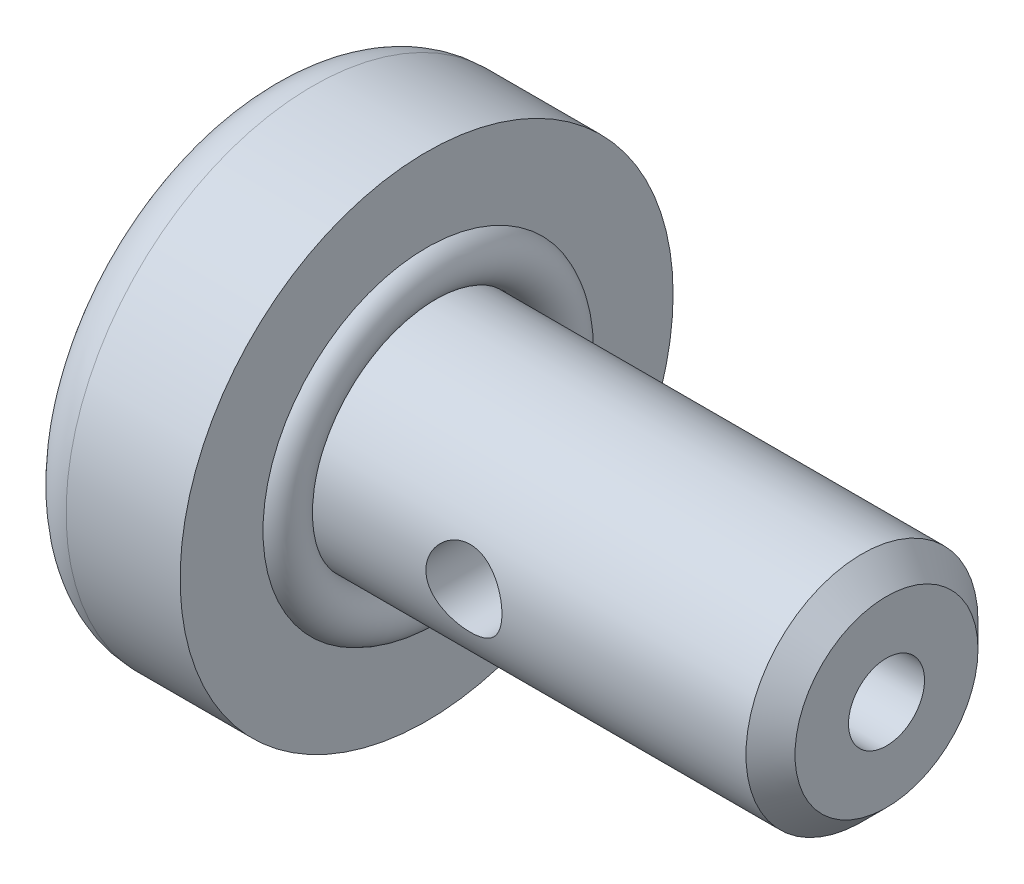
ISO-10303-21;
HEADER;
FILE_DESCRIPTION(('STEP AP214'),'2;1');
FILE_NAME('part.step','',(''),(''),'','','');
FILE_SCHEMA(('AUTOMOTIVE_DESIGN { 1 0 10303 214 1 1 1 1 }'));
ENDSEC;
DATA;
#1=APPLICATION_CONTEXT('core data for automotive mechanical design processes');
#2=APPLICATION_PROTOCOL_DEFINITION('international standard','automotive_design',2000,#1);
#3=PRODUCT_CONTEXT('',#1,'mechanical');
#4=PRODUCT('Part','Part','',(#3));
#5=PRODUCT_RELATED_PRODUCT_CATEGORY('part','',(#4));
#6=PRODUCT_DEFINITION_FORMATION('','',#4);
#7=PRODUCT_DEFINITION_CONTEXT('part definition',#1,'design');
#8=PRODUCT_DEFINITION('design','',#6,#7);
#9=PRODUCT_DEFINITION_SHAPE('','',#8);
#10=(LENGTH_UNIT() NAMED_UNIT(*) SI_UNIT(.MILLI.,.METRE.));
#11=(NAMED_UNIT(*) PLANE_ANGLE_UNIT() SI_UNIT($,.RADIAN.));
#12=(NAMED_UNIT(*) SI_UNIT($,.STERADIAN.) SOLID_ANGLE_UNIT());
#13=UNCERTAINTY_MEASURE_WITH_UNIT(LENGTH_MEASURE(1.E-05),#10,'distance_accuracy_value','');
#14=(GEOMETRIC_REPRESENTATION_CONTEXT(3) GLOBAL_UNCERTAINTY_ASSIGNED_CONTEXT((#13)) GLOBAL_UNIT_ASSIGNED_CONTEXT((#10,
#11,#12)) REPRESENTATION_CONTEXT('',''));
#15=CARTESIAN_POINT('',(0.,0.,0.));
#16=DIRECTION('',(0.,0.,1.));
#17=DIRECTION('',(1.,0.,0.));
#18=AXIS2_PLACEMENT_3D('',#15,#16,#17);
#19=CARTESIAN_POINT('',(-1.11022302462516E-13,-1.11022302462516E-13,-6.66133814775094E-13));
#20=DIRECTION('',(-1.,0.,0.));
#21=DIRECTION('',(0.,0.,1.));
#22=AXIS2_PLACEMENT_3D('',#19,#20,#21);
#23=PLANE('',#22);
#24=DIRECTION('',(0.,-0.866025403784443,-0.499999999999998));
#25=VECTOR('',#24,1.);
#26=CARTESIAN_POINT('',(-5.55111512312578E-13,-3.19189119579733E-13,-1.83308710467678));
#27=LINE('',#26,#25);
#28=CARTESIAN_POINT('',(-4.44089209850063E-13,1.58750000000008,-0.916543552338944));
#29=VERTEX_POINT('',#28);
#30=CARTESIAN_POINT('',(-5.55111512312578E-13,-3.19189119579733E-13,-1.83308710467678));
#31=VERTEX_POINT('',#30);
#32=EDGE_CURVE('E53',#29,#31,#27,.T.);
#33=ORIENTED_EDGE('',*,*,#32,.F.);
#34=DIRECTION('',(0.,0.,-1.));
#35=VECTOR('',#34,1.);
#36=CARTESIAN_POINT('',(-4.44089209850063E-13,1.58750000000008,-0.916543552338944));
#37=LINE('',#36,#35);
#38=CARTESIAN_POINT('',(1.11022302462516E-13,1.58749999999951,0.916543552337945));
#39=VERTEX_POINT('',#38);
#40=EDGE_CURVE('E131',#39,#29,#37,.T.);
#41=ORIENTED_EDGE('',*,*,#40,.F.);
#42=DIRECTION('',(0.,0.86602540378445,-0.500000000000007));
#43=VECTOR('',#42,1.);
#44=CARTESIAN_POINT('',(1.11022302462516E-13,1.58749999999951,0.916543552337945));
#45=LINE('',#44,#43);
#46=CARTESIAN_POINT('',(-3.33066907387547E-13,0.,1.83308710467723));
#47=VERTEX_POINT('',#46);
#48=EDGE_CURVE('E125',#47,#39,#45,.T.);
#49=ORIENTED_EDGE('',*,*,#48,.F.);
#50=DIRECTION('',(0.,0.86602540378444,0.500000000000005));
#51=VECTOR('',#50,1.);
#52=CARTESIAN_POINT('',(-3.33066907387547E-13,0.,1.83308710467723));
#53=LINE('',#52,#51);
#54=CARTESIAN_POINT('',(2.22044604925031E-13,-1.58750000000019,0.916543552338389));
#55=VERTEX_POINT('',#54);
#56=EDGE_CURVE('E123',#55,#47,#53,.T.);
#57=ORIENTED_EDGE('',*,*,#56,.F.);
#58=DIRECTION('',(0.,0.,1.));
#59=VECTOR('',#58,1.);
#60=CARTESIAN_POINT('',(2.22044604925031E-13,-1.58750000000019,0.916543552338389));
#61=LINE('',#60,#59);
#62=CARTESIAN_POINT('',(-1.11022302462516E-13,-1.58749999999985,-0.916543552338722));
#63=VERTEX_POINT('',#62);
#64=EDGE_CURVE('E105',#63,#55,#61,.T.);
#65=ORIENTED_EDGE('',*,*,#64,.F.);
#66=DIRECTION('',(0.,-0.866025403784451,0.500000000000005));
#67=VECTOR('',#66,1.);
#68=CARTESIAN_POINT('',(-1.11022302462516E-13,-1.58749999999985,-0.916543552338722));
#69=LINE('',#68,#67);
#70=EDGE_CURVE('E116',#31,#63,#69,.T.);
#71=ORIENTED_EDGE('',*,*,#70,.F.);
#72=EDGE_LOOP('',(#33,#41,#49,#57,#65,#71));
#73=FACE_BOUND('',#72,.T.);
#74=CARTESIAN_POINT('',(-1.11022302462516E-13,-1.11022302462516E-13,-6.66133814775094E-13));
#75=DIRECTION('',(1.,0.,0.));
#76=DIRECTION('',(0.,0.,-1.));
#77=AXIS2_PLACEMENT_3D('',#74,#75,#76);
#78=CIRCLE('',#77,4.0894);
#79=CARTESIAN_POINT('',(0.,-1.17836557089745E-13,-4.08940000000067));
#80=VERTEX_POINT('',#79);
#81=EDGE_CURVE('E166',#80,#80,#78,.T.);
#82=ORIENTED_EDGE('',*,*,#81,.F.);
#83=EDGE_LOOP('',(#82));
#84=FACE_BOUND('',#83,.T.);
#85=ADVANCED_FACE('F32',(#73,#84),#23,.T.);
#86=CARTESIAN_POINT('',(-1.11022302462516E-13,-1.11022302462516E-13,-6.66133814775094E-13));
#87=DIRECTION('',(1.,0.,0.));
#88=DIRECTION('',(0.,0.,-1.));
#89=AXIS2_PLACEMENT_3D('',#86,#87,#88);
#90=CYLINDRICAL_SURFACE('',#89,0.7874);
#91=CARTESIAN_POINT('',(6.55320000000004,1.17961196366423E-13,-2.22044604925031E-13));
#92=DIRECTION('',(0.707106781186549,0.,0.707106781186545));
#93=DIRECTION('',(0.707106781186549,0.,-0.707106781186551));
#94=AXIS2_PLACEMENT_3D('',#91,#92,#93);
#95=ELLIPSE('',#94,1.11355175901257,0.787399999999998);
#96=CARTESIAN_POINT('',(6.55319999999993,-0.78739999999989,1.14491749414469E-13));
#97=VERTEX_POINT('',#96);
#98=CARTESIAN_POINT('',(6.55319999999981,0.787399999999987,2.22044604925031E-13));
#99=VERTEX_POINT('',#98);
#100=EDGE_CURVE('E161',#97,#99,#95,.T.);
#101=ORIENTED_EDGE('',*,*,#100,.F.);
#102=CARTESIAN_POINT('',(6.55320000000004,1.17961196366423E-13,-2.22044604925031E-13));
#103=DIRECTION('',(0.707106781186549,0.,-0.707106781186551));
#104=DIRECTION('',(0.707106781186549,0.,0.707106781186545));
#105=AXIS2_PLACEMENT_3D('',#102,#103,#104);
#106=ELLIPSE('',#105,1.11355175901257,0.787399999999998);
#107=EDGE_CURVE('E159',#99,#97,#106,.T.);
#108=ORIENTED_EDGE('',*,*,#107,.F.);
#109=EDGE_LOOP('',(#101,#108));
#110=FACE_BOUND('',#109,.T.);
#111=CARTESIAN_POINT('',(12.9031999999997,2.15105711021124E-13,-2.22044604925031E-13));
#112=DIRECTION('',(1.,0.,0.));
#113=DIRECTION('',(0.,0.,-1.));
#114=AXIS2_PLACEMENT_3D('',#111,#112,#113);
#115=CIRCLE('',#114,0.7874);
#116=CARTESIAN_POINT('',(12.9031999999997,2.13793649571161E-13,-0.787400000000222));
#117=VERTEX_POINT('',#116);
#118=EDGE_CURVE('E181',#117,#117,#115,.T.);
#119=ORIENTED_EDGE('',*,*,#118,.T.);
#120=EDGE_LOOP('',(#119));
#121=FACE_BOUND('',#120,.T.);
#122=ADVANCED_FACE('F231',(#110,#121),#90,.F.);
#123=CARTESIAN_POINT('',(12.9032,0.78740000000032,2.22044604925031E-13));
#124=DIRECTION('',(1.,0.,0.));
#125=DIRECTION('',(0.,0.,-1.));
#126=AXIS2_PLACEMENT_3D('',#123,#124,#125);
#127=PLANE('',#126);
#128=CARTESIAN_POINT('',(12.9031999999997,2.15105711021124E-13,-2.22044604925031E-13));
#129=DIRECTION('',(1.,0.,0.));
#130=DIRECTION('',(0.,0.,-1.));
#131=AXIS2_PLACEMENT_3D('',#128,#129,#130);
#132=CIRCLE('',#131,1.89532853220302);
#133=CARTESIAN_POINT('',(12.9031999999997,2.1194748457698E-13,-1.89532853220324));
#134=VERTEX_POINT('',#133);
#135=EDGE_CURVE('E45',#134,#134,#132,.T.);
#136=ORIENTED_EDGE('',*,*,#135,.T.);
#137=EDGE_LOOP('',(#136));
#138=FACE_BOUND('',#137,.T.);
#139=ORIENTED_EDGE('',*,*,#118,.F.);
#140=EDGE_LOOP('',(#139));
#141=FACE_BOUND('',#140,.T.);
#142=ADVANCED_FACE('F227',(#138,#141),#127,.T.);
#143=CARTESIAN_POINT('',(-1.11022302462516E-13,-1.11022302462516E-13,-6.66133814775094E-13));
#144=DIRECTION('',(1.,0.,0.));
#145=DIRECTION('',(0.,0.,-1.));
#146=AXIS2_PLACEMENT_3D('',#143,#144,#145);
#147=CYLINDRICAL_SURFACE('',#146,2.40332853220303);
#148=CARTESIAN_POINT('',(5.76579999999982,-2.28983498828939E-13,-2.40332853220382));
#149=CARTESIAN_POINT('',(5.7657999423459,0.0430045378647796,-2.40332855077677));
#150=CARTESIAN_POINT('',(5.7693345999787,0.086009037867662,-2.40216354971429));
#151=CARTESIAN_POINT('',(5.78333831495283,0.170753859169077,-2.39763071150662));
#152=CARTESIAN_POINT('',(5.79380832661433,0.212494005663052,-2.39426257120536));
#153=CARTESIAN_POINT('',(5.82128710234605,0.29347607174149,-2.38568998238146));
#154=CARTESIAN_POINT('',(5.8382851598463,0.33272195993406,-2.38048854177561));
#155=CARTESIAN_POINT('',(5.87828991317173,0.40780603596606,-2.36878197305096));
#156=CARTESIAN_POINT('',(5.90129773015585,0.44364358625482,-2.36227660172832));
#157=CARTESIAN_POINT('',(5.95348117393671,0.512097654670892,-2.34840402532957));
#158=CARTESIAN_POINT('',(5.98282246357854,0.544583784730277,-2.34101668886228));
#159=CARTESIAN_POINT('',(6.04648760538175,0.604273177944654,-2.32632514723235));
#160=CARTESIAN_POINT('',(6.08081250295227,0.631475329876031,-2.31902095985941));
#161=CARTESIAN_POINT('',(6.15463171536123,0.680558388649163,-2.30510276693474));
#162=CARTESIAN_POINT('',(6.19424258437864,0.702271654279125,-2.29851338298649));
#163=CARTESIAN_POINT('',(6.27680454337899,0.738673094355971,-2.28707604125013));
#164=CARTESIAN_POINT('',(6.3197546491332,0.75336332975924,-2.28222757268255));
#165=CARTESIAN_POINT('',(6.4062962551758,0.774815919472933,-2.27503260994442));
#166=CARTESIAN_POINT('',(6.44982079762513,0.781821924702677,-2.27260944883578));
#167=CARTESIAN_POINT('',(6.53748985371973,0.788468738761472,-2.27031244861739));
#168=CARTESIAN_POINT('',(6.58163417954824,0.788111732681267,-2.27043785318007));
#169=CARTESIAN_POINT('',(6.66722947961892,0.780232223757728,-2.27315649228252));
#170=CARTESIAN_POINT('',(6.70871355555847,0.773025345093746,-2.27564101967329));
#171=CARTESIAN_POINT('',(6.78984768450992,0.752164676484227,-2.28262044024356));
#172=CARTESIAN_POINT('',(6.82949752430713,0.738510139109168,-2.28711556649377));
#173=CARTESIAN_POINT('',(6.90656444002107,0.704930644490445,-2.29768877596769));
#174=CARTESIAN_POINT('',(6.943936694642,0.684910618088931,-2.30379060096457));
#175=CARTESIAN_POINT('',(7.01489213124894,0.639234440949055,-2.31687947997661));
#176=CARTESIAN_POINT('',(7.04847424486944,0.613576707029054,-2.32386678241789));
#177=CARTESIAN_POINT('',(7.11267275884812,0.555828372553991,-2.33836935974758));
#178=CARTESIAN_POINT('',(7.14305486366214,0.523479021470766,-2.34589350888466));
#179=CARTESIAN_POINT('',(7.19802287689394,0.45405149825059,-2.36031369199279));
#180=CARTESIAN_POINT('',(7.2226082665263,0.416972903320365,-2.36720966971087));
#181=CARTESIAN_POINT('',(7.2654651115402,0.338655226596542,-2.37968177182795));
#182=CARTESIAN_POINT('',(7.28367572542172,0.297380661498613,-2.38524502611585));
#183=CARTESIAN_POINT('',(7.31282344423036,0.212128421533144,-2.39433159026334));
#184=CARTESIAN_POINT('',(7.32376298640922,0.168151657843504,-2.39785558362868));
#185=CARTESIAN_POINT('',(7.3376474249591,0.0807283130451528,-2.40235424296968));
#186=CARTESIAN_POINT('',(7.34090907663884,0.0373371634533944,-2.40342985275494));
#187=CARTESIAN_POINT('',(7.34024487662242,-0.0493798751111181,-2.40321212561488));
#188=CARTESIAN_POINT('',(7.33632019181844,-0.0927057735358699,-2.40191917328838));
#189=CARTESIAN_POINT('',(7.32164643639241,-0.176807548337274,-2.39717615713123));
#190=CARTESIAN_POINT('',(7.31109012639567,-0.217620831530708,-2.39378706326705));
#191=CARTESIAN_POINT('',(7.28369215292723,-0.296882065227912,-2.38525456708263));
#192=CARTESIAN_POINT('',(7.26684969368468,-0.335329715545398,-2.38011094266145));
#193=CARTESIAN_POINT('',(7.22687462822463,-0.409873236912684,-2.36842837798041));
#194=CARTESIAN_POINT('',(7.20359095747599,-0.445882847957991,-2.36185686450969));
#195=CARTESIAN_POINT('',(7.15157290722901,-0.513587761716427,-2.3480654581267));
#196=CARTESIAN_POINT('',(7.1228369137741,-0.545281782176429,-2.34084537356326));
#197=CARTESIAN_POINT('',(7.05923992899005,-0.604899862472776,-2.32617039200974));
#198=CARTESIAN_POINT('',(7.02416575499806,-0.632597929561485,-2.31871906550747));
#199=CARTESIAN_POINT('',(6.94970661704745,-0.681740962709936,-2.30474991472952));
#200=CARTESIAN_POINT('',(6.91032164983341,-0.703185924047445,-2.29823209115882));
#201=CARTESIAN_POINT('',(6.82837208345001,-0.739103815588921,-2.28693447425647));
#202=CARTESIAN_POINT('',(6.78581609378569,-0.753594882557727,-2.28215016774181));
#203=CARTESIAN_POINT('',(6.69867608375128,-0.77514359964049,-2.27492244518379));
#204=CARTESIAN_POINT('',(6.65409294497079,-0.782204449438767,-2.27247802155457));
#205=CARTESIAN_POINT('',(6.56654591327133,-0.788448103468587,-2.27031878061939));
#206=CARTESIAN_POINT('',(6.52361157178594,-0.788004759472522,-2.2704744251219));
#207=CARTESIAN_POINT('',(6.4384627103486,-0.780167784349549,-2.27317906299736));
#208=CARTESIAN_POINT('',(6.39624815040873,-0.772774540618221,-2.27572792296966));
#209=CARTESIAN_POINT('',(6.31447882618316,-0.751508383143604,-2.28283696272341));
#210=CARTESIAN_POINT('',(6.27489019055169,-0.737752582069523,-2.28736071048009));
#211=CARTESIAN_POINT('',(6.19855202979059,-0.704245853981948,-2.29789747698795));
#212=CARTESIAN_POINT('',(6.1618031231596,-0.684493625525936,-2.303910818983));
#213=CARTESIAN_POINT('',(6.09049930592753,-0.638576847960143,-2.31706716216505));
#214=CARTESIAN_POINT('',(6.05610348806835,-0.61217592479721,-2.32424725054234));
#215=CARTESIAN_POINT('',(5.99210948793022,-0.554115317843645,-2.33876860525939));
#216=CARTESIAN_POINT('',(5.96251264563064,-0.522454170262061,-2.3461099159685));
#217=CARTESIAN_POINT('',(5.90785016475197,-0.453358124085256,-2.36045401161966));
#218=CARTESIAN_POINT('',(5.88299379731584,-0.415752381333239,-2.36743407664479));
#219=CARTESIAN_POINT('',(5.83998427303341,-0.336669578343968,-2.37996661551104));
#220=CARTESIAN_POINT('',(5.82182913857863,-0.295193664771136,-2.3855195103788));
#221=CARTESIAN_POINT('',(5.79365775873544,-0.211935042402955,-2.39431086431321));
#222=CARTESIAN_POINT('',(5.78324357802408,-0.17029884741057,-2.39766126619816));
#223=CARTESIAN_POINT('',(5.7693156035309,-0.0857748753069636,-2.40216981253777));
#224=CARTESIAN_POINT('',(5.76580005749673,-0.042887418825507,-2.40332851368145));
#225=CARTESIAN_POINT('',(5.76579999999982,-2.28983498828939E-13,-2.40332853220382));
#226=B_SPLINE_CURVE_WITH_KNOTS('',3,(#148,#149,#150,#151,#152,#153,#154,#155,#156,#157,#158,
#159,#160,#161,#162,#163,#164,#165,#166,#167,#168,#169,#170,#171,#172,#173,#174,#175,#176,#177,
#178,#179,#180,#181,#182,#183,#184,#185,#186,#187,#188,#189,#190,#191,#192,#193,#194,#195,#196,
#197,#198,#199,#200,#201,#202,#203,#204,#205,#206,#207,#208,#209,#210,#211,#212,#213,#214,#215,
#216,#217,#218,#219,#220,#221,#222,#223,#224,#225),.UNSPECIFIED.,.T.,.F.,(4,2,2,2,2,2,2,2,2,2,2,
2,2,2,2,2,2,2,2,2,2,2,2,2,2,2,2,2,2,2,2,2,2,2,2,2,2,2,4),(0.,0.128855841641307,
0.257729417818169,0.386392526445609,0.51507965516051,0.647663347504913,0.780274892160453,
0.916547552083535,1.05278019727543,1.18455574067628,1.31629217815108,1.44223859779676,
1.56819962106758,1.69613800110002,1.824112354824,1.95852693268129,2.09295353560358,
2.2286302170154,2.36426139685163,2.49419074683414,2.6240990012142,2.7503956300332,
2.87670825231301,3.00627950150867,3.13588916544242,3.27117702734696,3.40646499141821,
3.54139816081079,3.67627319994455,3.80444957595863,3.93261880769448,4.05851742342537,
4.18444338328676,4.31570864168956,4.4470104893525,4.58319194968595,4.71933318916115,
4.84787075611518,4.9763756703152),.UNSPECIFIED.);
#227=CARTESIAN_POINT('',(5.76579999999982,-2.28983498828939E-13,-2.40332853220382));
#228=VERTEX_POINT('',#227);
#229=EDGE_CURVE('E35',#228,#228,#226,.T.);
#230=ORIENTED_EDGE('',*,*,#229,.F.);
#231=EDGE_LOOP('',(#230));
#232=FACE_BOUND('',#231,.T.);
#233=CARTESIAN_POINT('',(7.34060000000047,-3.33066907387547E-13,2.40332853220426));
#234=CARTESIAN_POINT('',(7.34060005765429,0.0430045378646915,2.40332855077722));
#235=CARTESIAN_POINT('',(7.33706540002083,0.0860090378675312,2.40216354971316));
#236=CARTESIAN_POINT('',(7.32306168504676,0.170753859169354,2.39763071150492));
#237=CARTESIAN_POINT('',(7.31259167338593,0.212494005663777,2.39426257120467));
#238=CARTESIAN_POINT('',(7.28511289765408,0.293476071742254,2.38568998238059));
#239=CARTESIAN_POINT('',(7.26811484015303,0.332721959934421,2.38048854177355));
#240=CARTESIAN_POINT('',(7.22811008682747,0.407806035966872,2.36878197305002));
#241=CARTESIAN_POINT('',(7.20510226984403,0.443643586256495,2.36227660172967));
#242=CARTESIAN_POINT('',(7.15291882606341,0.512097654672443,2.34840402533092));
#243=CARTESIAN_POINT('',(7.12357753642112,0.544583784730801,2.34101668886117));
#244=CARTESIAN_POINT('',(7.05991239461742,0.604273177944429,2.32632514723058));
#245=CARTESIAN_POINT('',(7.02558749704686,0.631475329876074,2.31902095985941));
#246=CARTESIAN_POINT('',(6.95176828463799,0.680558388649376,2.30510276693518));
#247=CARTESIAN_POINT('',(6.91215741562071,0.702271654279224,2.29851338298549));
#248=CARTESIAN_POINT('',(6.82959545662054,0.738673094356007,2.28707604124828));
#249=CARTESIAN_POINT('',(6.78664535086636,0.75336332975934,2.2822275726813));
#250=CARTESIAN_POINT('',(6.70010374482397,0.774815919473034,2.27503260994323));
#251=CARTESIAN_POINT('',(6.6565792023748,0.78182192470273,2.27260944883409));
#252=CARTESIAN_POINT('',(6.56891014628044,0.788468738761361,2.27031244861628));
#253=CARTESIAN_POINT('',(6.52476582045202,0.788111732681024,2.27043785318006));
#254=CARTESIAN_POINT('',(6.43917052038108,0.780232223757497,2.27315649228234));
#255=CARTESIAN_POINT('',(6.39768644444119,0.773025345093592,2.27564101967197));
#256=CARTESIAN_POINT('',(6.31655231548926,0.752164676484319,2.28262044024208));
#257=CARTESIAN_POINT('',(6.2769024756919,0.738510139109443,2.28711556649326));
#258=CARTESIAN_POINT('',(6.19983555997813,0.704930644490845,2.29768877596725));
#259=CARTESIAN_POINT('',(6.16246330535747,0.684910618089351,2.30379060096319));
#260=CARTESIAN_POINT('',(6.09150786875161,0.639234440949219,2.31687947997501));
#261=CARTESIAN_POINT('',(6.05792575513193,0.613576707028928,2.32386678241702));
#262=CARTESIAN_POINT('',(5.99372724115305,0.555828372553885,2.33836935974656));
#263=CARTESIAN_POINT('',(5.96334513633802,0.523479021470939,2.34589350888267));
#264=CARTESIAN_POINT('',(5.90837712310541,0.454051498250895,2.36031369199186));
#265=CARTESIAN_POINT('',(5.88379173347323,0.416972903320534,2.36720966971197));
#266=CARTESIAN_POINT('',(5.84093488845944,0.338655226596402,2.37968177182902));
#267=CARTESIAN_POINT('',(5.82272427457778,0.297380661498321,2.38524502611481));
#268=CARTESIAN_POINT('',(5.79357655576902,0.212128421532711,2.39433159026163));
#269=CARTESIAN_POINT('',(5.78263701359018,0.168151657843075,2.3978555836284));
#270=CARTESIAN_POINT('',(5.76875257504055,0.0807283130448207,2.4023542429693));
#271=CARTESIAN_POINT('',(5.765490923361,0.0373371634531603,2.40342985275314));
#272=CARTESIAN_POINT('',(5.76615512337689,-0.0493798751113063,2.40321212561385));
#273=CARTESIAN_POINT('',(5.77007980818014,-0.0927057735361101,2.40191917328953));
#274=CARTESIAN_POINT('',(5.78475356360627,-0.176807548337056,2.39717615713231));
#275=CARTESIAN_POINT('',(5.79530987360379,-0.217620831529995,2.393787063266));
#276=CARTESIAN_POINT('',(5.82270784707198,-0.29688206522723,2.38525456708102));
#277=CARTESIAN_POINT('',(5.83955030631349,-0.335329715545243,2.3801109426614));
#278=CARTESIAN_POINT('',(5.87952537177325,-0.40987323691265,2.36842837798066));
#279=CARTESIAN_POINT('',(5.90280904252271,-0.4458828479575,2.36185686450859));
#280=CARTESIAN_POINT('',(5.95482709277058,-0.513587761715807,2.34806545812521));
#281=CARTESIAN_POINT('',(5.98356308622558,-0.545281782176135,2.34084537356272));
#282=CARTESIAN_POINT('',(6.04716007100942,-0.604899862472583,2.32617039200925));
#283=CARTESIAN_POINT('',(6.08223424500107,-0.632597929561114,2.318719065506));
#284=CARTESIAN_POINT('',(6.15669338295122,-0.681740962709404,2.30474991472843));
#285=CARTESIAN_POINT('',(6.19607835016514,-0.703185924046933,2.29823209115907));
#286=CARTESIAN_POINT('',(6.27802791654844,-0.73910381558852,2.2869344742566));
#287=CARTESIAN_POINT('',(6.32058390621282,-0.753594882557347,2.28215016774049));
#288=CARTESIAN_POINT('',(6.40772391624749,-0.775143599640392,2.27492244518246));
#289=CARTESIAN_POINT('',(6.45230705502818,-0.782204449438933,2.27247802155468));
#290=CARTESIAN_POINT('',(6.53985408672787,-0.788448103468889,2.2703187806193));
#291=CARTESIAN_POINT('',(6.58278842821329,-0.788004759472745,2.2704744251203));
#292=CARTESIAN_POINT('',(6.66793728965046,-0.78016778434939,2.27317906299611));
#293=CARTESIAN_POINT('',(6.71015184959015,-0.772774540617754,2.27572792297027));
#294=CARTESIAN_POINT('',(6.79192117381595,-0.751508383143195,2.28283696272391));
#295=CARTESIAN_POINT('',(6.83150980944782,-0.73775258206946,2.2873607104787));
#296=CARTESIAN_POINT('',(6.90784797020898,-0.704245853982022,2.29789747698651));
#297=CARTESIAN_POINT('',(6.94459687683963,-0.684493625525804,2.3039108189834));
#298=CARTESIAN_POINT('',(7.0159006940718,-0.638576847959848,2.3170671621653));
#299=CARTESIAN_POINT('',(7.05029651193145,-0.612175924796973,2.32424725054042));
#300=CARTESIAN_POINT('',(7.11429051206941,-0.554115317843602,2.33876860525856));
#301=CARTESIAN_POINT('',(7.14388735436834,-0.522454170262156,2.34610991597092));
#302=CARTESIAN_POINT('',(7.19854983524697,-0.453358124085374,2.36045401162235));
#303=CARTESIAN_POINT('',(7.22340620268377,-0.415752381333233,2.36743407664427));
#304=CARTESIAN_POINT('',(7.26641572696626,-0.336669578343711,2.37996661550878));
#305=CARTESIAN_POINT('',(7.28457086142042,-0.295193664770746,2.38551951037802));
#306=CARTESIAN_POINT('',(7.31274224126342,-0.211935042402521,2.39431086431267));
#307=CARTESIAN_POINT('',(7.32315642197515,-0.170298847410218,2.39766126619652));
#308=CARTESIAN_POINT('',(7.33708439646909,-0.0857748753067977,2.40216981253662));
#309=CARTESIAN_POINT('',(7.34059994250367,-0.0428874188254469,2.40332851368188));
#310=CARTESIAN_POINT('',(7.34060000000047,-3.33066907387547E-13,2.40332853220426));
#311=B_SPLINE_CURVE_WITH_KNOTS('',3,(#233,#234,#235,#236,#237,#238,#239,#240,#241,#242,#243,
#244,#245,#246,#247,#248,#249,#250,#251,#252,#253,#254,#255,#256,#257,#258,#259,#260,#261,#262,
#263,#264,#265,#266,#267,#268,#269,#270,#271,#272,#273,#274,#275,#276,#277,#278,#279,#280,#281,
#282,#283,#284,#285,#286,#287,#288,#289,#290,#291,#292,#293,#294,#295,#296,#297,#298,#299,#300,
#301,#302,#303,#304,#305,#306,#307,#308,#309,#310),.UNSPECIFIED.,.T.,.F.,(4,2,2,2,2,2,2,2,2,2,2,
2,2,2,2,2,2,2,2,2,2,2,2,2,2,2,2,2,2,2,2,2,2,2,2,2,2,2,4),(0.,0.128855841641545,
0.257729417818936,0.386392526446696,0.515079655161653,0.647663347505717,0.780274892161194,
0.916547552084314,1.05278019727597,1.18455574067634,1.31629217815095,1.44223859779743,
1.56819962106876,1.69613800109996,1.824112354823,1.95852693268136,2.0929535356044,
2.22863021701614,2.36426139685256,2.49419074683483,2.62409900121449,2.75039563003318,
2.87670825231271,3.00627950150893,3.1358891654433,3.27117702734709,3.40646499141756,
3.54139816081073,3.67627319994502,3.80444957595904,3.93261880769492,4.05851742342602,
4.18444338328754,4.31570864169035,4.44701048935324,4.58319194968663,4.71933318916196,
4.84787075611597,4.97637567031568),.UNSPECIFIED.);
#312=CARTESIAN_POINT('',(7.34060000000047,-3.33066907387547E-13,2.40332853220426));
#313=VERTEX_POINT('',#312);
#314=EDGE_CURVE('E151',#313,#313,#311,.T.);
#315=ORIENTED_EDGE('',*,*,#314,.F.);
#316=EDGE_LOOP('',(#315));
#317=FACE_BOUND('',#316,.T.);
#318=CARTESIAN_POINT('',(12.3951999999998,-1.10328413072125E-12,2.11289319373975E-12));
#319=DIRECTION('',(1.,0.,0.));
#320=DIRECTION('',(0.,0.,-1.));
#321=AXIS2_PLACEMENT_3D('',#318,#319,#320);
#322=CIRCLE('',#321,2.40332853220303);
#323=CARTESIAN_POINT('',(12.3951999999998,-1.10728884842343E-12,-2.40332853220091));
#324=VERTEX_POINT('',#323);
#325=EDGE_CURVE('E11',#324,#324,#322,.F.);
#326=ORIENTED_EDGE('',*,*,#325,.T.);
#327=EDGE_LOOP('',(#326));
#328=FACE_BOUND('',#327,.T.);
#329=CARTESIAN_POINT('',(3.20588046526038,-1.17961196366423E-13,-1.11022302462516E-12));
#330=DIRECTION('',(1.,0.,0.));
#331=DIRECTION('',(0.,0.,-1.));
#332=AXIS2_PLACEMENT_3D('',#329,#330,#331);
#333=CIRCLE('',#332,2.40332853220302);
#334=CARTESIAN_POINT('',(3.20588046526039,-1.21965914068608E-13,-2.40332853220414));
#335=VERTEX_POINT('',#334);
#336=EDGE_CURVE('E178',#335,#335,#333,.T.);
#337=ORIENTED_EDGE('',*,*,#336,.T.);
#338=EDGE_LOOP('',(#337));
#339=FACE_BOUND('',#338,.T.);
#340=ADVANCED_FACE('F192',(#232,#317,#328,#339),#147,.T.);
#341=CARTESIAN_POINT('',(3.20588046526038,-1.17961196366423E-13,-1.11022302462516E-12));
#342=DIRECTION('',(1.,0.,0.));
#343=DIRECTION('',(0.,0.,-1.));
#344=AXIS2_PLACEMENT_3D('',#341,#342,#343);
#345=TOROIDAL_SURFACE('',#344,2.91132853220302,0.508);
#346=CARTESIAN_POINT('',(3.37819999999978,-3.40005801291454E-13,-2.22044604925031E-13));
#347=DIRECTION('',(1.,0.,0.));
#348=DIRECTION('',(0.,0.,-1.));
#349=AXIS2_PLACEMENT_3D('',#346,#347,#348);
#350=CIRCLE('',#349,3.38920924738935);
#351=CARTESIAN_POINT('',(3.3781999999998,-3.45653313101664E-13,-3.38920924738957));
#352=VERTEX_POINT('',#351);
#353=EDGE_CURVE('E175',#352,#352,#350,.T.);
#354=ORIENTED_EDGE('',*,*,#353,.T.);
#355=EDGE_LOOP('',(#354));
#356=FACE_BOUND('',#355,.T.);
#357=ORIENTED_EDGE('',*,*,#336,.F.);
#358=EDGE_LOOP('',(#357));
#359=FACE_BOUND('',#358,.T.);
#360=ADVANCED_FACE('F220',(#356,#359),#345,.T.);
#361=CARTESIAN_POINT('',(3.37819999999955,3.38920924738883,4.47558656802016E-13));
#362=DIRECTION('',(1.,0.,0.));
#363=DIRECTION('',(0.,0.,-1.));
#364=AXIS2_PLACEMENT_3D('',#361,#362,#363);
#365=PLANE('',#364);
#366=CARTESIAN_POINT('',(3.37819999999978,-3.40005801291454E-13,-2.22044604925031E-13));
#367=DIRECTION('',(1.,0.,0.));
#368=DIRECTION('',(0.,0.,-1.));
#369=AXIS2_PLACEMENT_3D('',#366,#367,#368);
#370=CIRCLE('',#369,5.1054);
#371=CARTESIAN_POINT('',(3.37819999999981,-3.48513038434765E-13,-5.10540000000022));
#372=VERTEX_POINT('',#371);
#373=EDGE_CURVE('E172',#372,#372,#370,.T.);
#374=ORIENTED_EDGE('',*,*,#373,.T.);
#375=EDGE_LOOP('',(#374));
#376=FACE_BOUND('',#375,.T.);
#377=ORIENTED_EDGE('',*,*,#353,.F.);
#378=EDGE_LOOP('',(#377));
#379=FACE_BOUND('',#378,.T.);
#380=ADVANCED_FACE('F217',(#376,#379),#365,.T.);
#381=CARTESIAN_POINT('',(-1.11022302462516E-13,-1.11022302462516E-13,-6.66133814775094E-13));
#382=DIRECTION('',(1.,0.,0.));
#383=DIRECTION('',(0.,0.,-1.));
#384=AXIS2_PLACEMENT_3D('',#381,#382,#383);
#385=CYLINDRICAL_SURFACE('',#384,5.1054);
#386=CARTESIAN_POINT('',(1.01599999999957,2.28983498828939E-13,3.33066907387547E-13));
#387=DIRECTION('',(1.,0.,0.));
#388=DIRECTION('',(0.,0.,-1.));
#389=AXIS2_PLACEMENT_3D('',#386,#387,#388);
#390=CIRCLE('',#389,5.1054);
#391=CARTESIAN_POINT('',(1.0159999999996,2.20476261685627E-13,-5.10539999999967));
#392=VERTEX_POINT('',#391);
#393=EDGE_CURVE('E169',#392,#392,#390,.T.);
#394=ORIENTED_EDGE('',*,*,#393,.T.);
#395=EDGE_LOOP('',(#394));
#396=FACE_BOUND('',#395,.T.);
#397=ORIENTED_EDGE('',*,*,#373,.F.);
#398=EDGE_LOOP('',(#397));
#399=FACE_BOUND('',#398,.T.);
#400=ADVANCED_FACE('F213',(#396,#399),#385,.T.);
#401=CARTESIAN_POINT('',(1.01599999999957,2.28983498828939E-13,3.33066907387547E-13));
#402=DIRECTION('',(1.,0.,0.));
#403=DIRECTION('',(0.,0.,-1.));
#404=AXIS2_PLACEMENT_3D('',#401,#402,#403);
#405=TOROIDAL_SURFACE('',#404,4.0894,1.016);
#406=ORIENTED_EDGE('',*,*,#81,.T.);
#407=EDGE_LOOP('',(#406));
#408=FACE_BOUND('',#407,.T.);
#409=ORIENTED_EDGE('',*,*,#393,.F.);
#410=EDGE_LOOP('',(#409));
#411=FACE_BOUND('',#410,.T.);
#412=ADVANCED_FACE('F209',(#408,#411),#405,.T.);
#413=CARTESIAN_POINT('',(12.9031999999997,2.15105711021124E-13,-2.22044604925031E-13));
#414=DIRECTION('',(-1.,0.,0.));
#415=DIRECTION('',(0.,0.,1.));
#416=AXIS2_PLACEMENT_3D('',#413,#414,#415);
#417=CONICAL_SURFACE('',#416,1.89532853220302,0.785398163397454);
#418=ORIENTED_EDGE('',*,*,#325,.F.);
#419=EDGE_LOOP('',(#418));
#420=FACE_BOUND('',#419,.T.);
#421=ORIENTED_EDGE('',*,*,#135,.F.);
#422=EDGE_LOOP('',(#421));
#423=FACE_BOUND('',#422,.T.);
#424=ADVANCED_FACE('F202',(#420,#423),#417,.T.);
#425=CARTESIAN_POINT('',(6.55319999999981,-1.04083408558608E-13,-5.10540000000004));
#426=DIRECTION('',(0.,0.,1.));
#427=DIRECTION('',(1.,0.,0.));
#428=AXIS2_PLACEMENT_3D('',#425,#426,#427);
#429=CYLINDRICAL_SURFACE('',#428,0.787399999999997);
#430=CARTESIAN_POINT('',(6.55320000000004,1.17961196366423E-13,-2.22044604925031E-13));
#431=DIRECTION('',(0.707106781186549,0.,0.707106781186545));
#432=DIRECTION('',(0.707106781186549,0.,-0.707106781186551));
#433=AXIS2_PLACEMENT_3D('',#430,#431,#432);
#434=ELLIPSE('',#433,1.11355175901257,0.787399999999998);
#435=EDGE_CURVE('E163',#97,#99,#434,.F.);
#436=ORIENTED_EDGE('',*,*,#435,.T.);
#437=ORIENTED_EDGE('',*,*,#107,.T.);
#438=EDGE_LOOP('',(#436,#437));
#439=FACE_BOUND('',#438,.T.);
#440=ORIENTED_EDGE('',*,*,#314,.T.);
#441=EDGE_LOOP('',(#440));
#442=FACE_BOUND('',#441,.T.);
#443=ADVANCED_FACE('F196',(#439,#442),#429,.F.);
#444=ORIENTED_EDGE('',*,*,#100,.T.);
#445=CARTESIAN_POINT('',(6.55320000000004,1.17961196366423E-13,-2.22044604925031E-13));
#446=DIRECTION('',(0.707106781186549,0.,-0.707106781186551));
#447=DIRECTION('',(0.707106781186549,0.,0.707106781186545));
#448=AXIS2_PLACEMENT_3D('',#445,#446,#447);
#449=ELLIPSE('',#448,1.11355175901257,0.787399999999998);
#450=EDGE_CURVE('E60',#99,#97,#449,.F.);
#451=ORIENTED_EDGE('',*,*,#450,.T.);
#452=EDGE_LOOP('',(#444,#451));
#453=FACE_BOUND('',#452,.T.);
#454=ORIENTED_EDGE('',*,*,#229,.T.);
#455=EDGE_LOOP('',(#454));
#456=FACE_BOUND('',#455,.T.);
#457=ADVANCED_FACE('F201',(#453,#456),#429,.F.);
#458=CARTESIAN_POINT('',(4.83092177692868,-3.2612801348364E-13,0.));
#459=DIRECTION('',(1.,0.,0.));
#460=DIRECTION('',(0.,0.,-1.));
#461=AXIS2_PLACEMENT_3D('',#458,#459,#460);
#462=CONICAL_SURFACE('',#461,0.,1.04941722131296);
#463=CARTESIAN_POINT('',(5.28319999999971,-5.62050406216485E-13,-1.07552855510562E-13));
#464=DIRECTION('',(1.,0.,0.));
#465=DIRECTION('',(0.,0.,-1.));
#466=AXIS2_PLACEMENT_3D('',#463,#464,#465);
#467=CIRCLE('',#466,0.787399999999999);
#468=CARTESIAN_POINT('',(5.28319999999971,-5.63362467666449E-13,-0.787400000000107));
#469=VERTEX_POINT('',#468);
#470=EDGE_CURVE('E184',#469,#469,#467,.T.);
#471=ORIENTED_EDGE('',*,*,#470,.T.);
#472=EDGE_LOOP('',(#471));
#473=FACE_BOUND('',#472,.T.);
#474=CARTESIAN_POINT('',(4.83092177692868,-3.2612801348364E-13,0.));
#475=VERTEX_POINT('',#474);
#476=VERTEX_LOOP('',#475);
#477=FACE_BOUND('',#476,.T.);
#478=ADVANCED_FACE('F245',(#473,#477),#462,.F.);
#479=ORIENTED_EDGE('',*,*,#435,.F.);
#480=ORIENTED_EDGE('',*,*,#450,.F.);
#481=EDGE_LOOP('',(#479,#480));
#482=FACE_BOUND('',#481,.T.);
#483=ORIENTED_EDGE('',*,*,#470,.F.);
#484=EDGE_LOOP('',(#483));
#485=FACE_BOUND('',#484,.T.);
#486=ADVANCED_FACE('F237',(#482,#485),#90,.F.);
#487=CARTESIAN_POINT('',(3.17500000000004,-2.15105711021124E-13,-1.83308710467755));
#488=DIRECTION('',(0.,0.499999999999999,-0.866025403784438));
#489=DIRECTION('',(0.,0.866025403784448,0.49999999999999));
#490=AXIS2_PLACEMENT_3D('',#487,#488,#489);
#491=PLANE('',#490);
#492=ORIENTED_EDGE('',*,*,#32,.T.);
#493=DIRECTION('',(-1.,0.,0.));
#494=VECTOR('',#493,1.);
#495=CARTESIAN_POINT('',(3.17500000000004,-2.15105711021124E-13,-1.83308710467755));
#496=LINE('',#495,#494);
#497=CARTESIAN_POINT('',(3.17500000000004,-2.15105711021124E-13,-1.83308710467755));
#498=VERTEX_POINT('',#497);
#499=EDGE_CURVE('E113',#498,#31,#496,.T.);
#500=ORIENTED_EDGE('',*,*,#499,.F.);
#501=DIRECTION('',(0.,-0.866025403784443,-0.499999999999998));
#502=VECTOR('',#501,1.);
#503=CARTESIAN_POINT('',(3.17500000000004,-2.15105711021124E-13,-1.83308710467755));
#504=LINE('',#503,#502);
#505=CARTESIAN_POINT('',(3.17499999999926,1.58749999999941,-0.916543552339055));
#506=VERTEX_POINT('',#505);
#507=EDGE_CURVE('E134',#506,#498,#504,.T.);
#508=ORIENTED_EDGE('',*,*,#507,.F.);
#509=DIRECTION('',(-1.,0.,0.));
#510=VECTOR('',#509,1.);
#511=CARTESIAN_POINT('',(3.17499999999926,1.58749999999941,-0.916543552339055));
#512=LINE('',#511,#510);
#513=EDGE_CURVE('E149',#506,#29,#512,.T.);
#514=ORIENTED_EDGE('',*,*,#513,.T.);
#515=EDGE_LOOP('',(#492,#500,#508,#514));
#516=FACE_BOUND('',#515,.T.);
#517=ADVANCED_FACE('F204',(#516),#491,.F.);
#518=CARTESIAN_POINT('',(3.17499999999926,1.58749999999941,-0.916543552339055));
#519=DIRECTION('',(0.,0.999999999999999,0.));
#520=DIRECTION('',(0.,0.,1.));
#521=AXIS2_PLACEMENT_3D('',#518,#519,#520);
#522=PLANE('',#521);
#523=ORIENTED_EDGE('',*,*,#40,.T.);
#524=ORIENTED_EDGE('',*,*,#513,.F.);
#525=DIRECTION('',(0.,0.,-1.));
#526=VECTOR('',#525,1.);
#527=CARTESIAN_POINT('',(3.17499999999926,1.58749999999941,-0.916543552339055));
#528=LINE('',#527,#526);
#529=CARTESIAN_POINT('',(3.17500000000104,1.58749999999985,0.916543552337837));
#530=VERTEX_POINT('',#529);
#531=EDGE_CURVE('E146',#530,#506,#528,.T.);
#532=ORIENTED_EDGE('',*,*,#531,.F.);
#533=DIRECTION('',(-1.,0.,0.));
#534=VECTOR('',#533,1.);
#535=CARTESIAN_POINT('',(3.17500000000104,1.58749999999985,0.916543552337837));
#536=LINE('',#535,#534);
#537=EDGE_CURVE('E152',#530,#39,#536,.T.);
#538=ORIENTED_EDGE('',*,*,#537,.T.);
#539=EDGE_LOOP('',(#523,#524,#532,#538));
#540=FACE_BOUND('',#539,.T.);
#541=ADVANCED_FACE('F250',(#540),#522,.F.);
#542=CARTESIAN_POINT('',(3.17500000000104,1.58749999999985,0.916543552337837));
#543=DIRECTION('',(0.,0.500000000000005,0.866025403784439));
#544=DIRECTION('',(0.,-0.86602540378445,0.500000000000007));
#545=AXIS2_PLACEMENT_3D('',#542,#543,#544);
#546=PLANE('',#545);
#547=ORIENTED_EDGE('',*,*,#48,.T.);
#548=ORIENTED_EDGE('',*,*,#537,.F.);
#549=DIRECTION('',(0.,0.86602540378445,-0.500000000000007));
#550=VECTOR('',#549,1.);
#551=CARTESIAN_POINT('',(3.17500000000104,1.58749999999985,0.916543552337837));
#552=LINE('',#551,#550);
#553=CARTESIAN_POINT('',(3.17500000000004,0.,1.83308710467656));
#554=VERTEX_POINT('',#553);
#555=EDGE_CURVE('E143',#554,#530,#552,.T.);
#556=ORIENTED_EDGE('',*,*,#555,.F.);
#557=DIRECTION('',(-1.,0.,0.));
#558=VECTOR('',#557,1.);
#559=CARTESIAN_POINT('',(3.17500000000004,0.,1.83308710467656));
#560=LINE('',#559,#558);
#561=EDGE_CURVE('E154',#554,#47,#560,.T.);
#562=ORIENTED_EDGE('',*,*,#561,.T.);
#563=EDGE_LOOP('',(#547,#548,#556,#562));
#564=FACE_BOUND('',#563,.T.);
#565=ADVANCED_FACE('F303',(#564),#546,.F.);
#566=CARTESIAN_POINT('',(3.17500000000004,0.,1.83308710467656));
#567=DIRECTION('',(0.,-0.500000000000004,0.866025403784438));
#568=DIRECTION('',(0.,-0.86602540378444,-0.500000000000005));
#569=AXIS2_PLACEMENT_3D('',#566,#567,#568);
#570=PLANE('',#569);
#571=ORIENTED_EDGE('',*,*,#56,.T.);
#572=ORIENTED_EDGE('',*,*,#561,.F.);
#573=DIRECTION('',(0.,0.86602540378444,0.500000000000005));
#574=VECTOR('',#573,1.);
#575=CARTESIAN_POINT('',(3.17500000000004,0.,1.83308710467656));
#576=LINE('',#575,#574);
#577=CARTESIAN_POINT('',(3.17500000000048,-1.5875000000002,0.916543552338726));
#578=VERTEX_POINT('',#577);
#579=EDGE_CURVE('E140',#578,#554,#576,.T.);
#580=ORIENTED_EDGE('',*,*,#579,.F.);
#581=DIRECTION('',(-1.,0.,0.));
#582=VECTOR('',#581,1.);
#583=CARTESIAN_POINT('',(3.17500000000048,-1.5875000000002,0.916543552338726));
#584=LINE('',#583,#582);
#585=EDGE_CURVE('E112',#578,#55,#584,.T.);
#586=ORIENTED_EDGE('',*,*,#585,.T.);
#587=EDGE_LOOP('',(#571,#572,#580,#586));
#588=FACE_BOUND('',#587,.T.);
#589=ADVANCED_FACE('F313',(#588),#570,.F.);
#590=CARTESIAN_POINT('',(3.17500000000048,-1.5875000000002,0.916543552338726));
#591=DIRECTION('',(0.,-0.999999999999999,0.));
#592=DIRECTION('',(0.,0.,-1.));
#593=AXIS2_PLACEMENT_3D('',#590,#591,#592);
#594=PLANE('',#593);
#595=ORIENTED_EDGE('',*,*,#64,.T.);
#596=ORIENTED_EDGE('',*,*,#585,.F.);
#597=DIRECTION('',(0.,0.,1.));
#598=VECTOR('',#597,1.);
#599=CARTESIAN_POINT('',(3.17500000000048,-1.5875000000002,0.916543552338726));
#600=LINE('',#599,#598);
#601=CARTESIAN_POINT('',(3.17499999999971,-1.58750000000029,-0.916543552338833));
#602=VERTEX_POINT('',#601);
#603=EDGE_CURVE('E108',#602,#578,#600,.T.);
#604=ORIENTED_EDGE('',*,*,#603,.F.);
#605=DIRECTION('',(-1.,0.,0.));
#606=VECTOR('',#605,1.);
#607=CARTESIAN_POINT('',(3.17499999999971,-1.58750000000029,-0.916543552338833));
#608=LINE('',#607,#606);
#609=EDGE_CURVE('E101',#602,#63,#608,.T.);
#610=ORIENTED_EDGE('',*,*,#609,.T.);
#611=EDGE_LOOP('',(#595,#596,#604,#610));
#612=FACE_BOUND('',#611,.T.);
#613=ADVANCED_FACE('F103',(#612),#594,.F.);
#614=CARTESIAN_POINT('',(3.17499999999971,-1.58750000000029,-0.916543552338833));
#615=DIRECTION('',(0.,-0.500000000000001,-0.866025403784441));
#616=DIRECTION('',(0.,0.866025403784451,-0.500000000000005));
#617=AXIS2_PLACEMENT_3D('',#614,#615,#616);
#618=PLANE('',#617);
#619=ORIENTED_EDGE('',*,*,#70,.T.);
#620=ORIENTED_EDGE('',*,*,#609,.F.);
#621=DIRECTION('',(0.,-0.866025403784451,0.500000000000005));
#622=VECTOR('',#621,1.);
#623=CARTESIAN_POINT('',(3.17499999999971,-1.58750000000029,-0.916543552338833));
#624=LINE('',#623,#622);
#625=EDGE_CURVE('E137',#498,#602,#624,.T.);
#626=ORIENTED_EDGE('',*,*,#625,.F.);
#627=ORIENTED_EDGE('',*,*,#499,.T.);
#628=EDGE_LOOP('',(#619,#620,#626,#627));
#629=FACE_BOUND('',#628,.T.);
#630=ADVANCED_FACE('F117',(#629),#618,.F.);
#631=CARTESIAN_POINT('',(3.17499999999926,1.58749999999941,-0.916543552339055));
#632=DIRECTION('',(1.,0.,0.));
#633=DIRECTION('',(0.,0.,-1.));
#634=AXIS2_PLACEMENT_3D('',#631,#632,#633);
#635=PLANE('',#634);
#636=ORIENTED_EDGE('',*,*,#507,.T.);
#637=ORIENTED_EDGE('',*,*,#625,.T.);
#638=ORIENTED_EDGE('',*,*,#603,.T.);
#639=ORIENTED_EDGE('',*,*,#579,.T.);
#640=ORIENTED_EDGE('',*,*,#555,.T.);
#641=ORIENTED_EDGE('',*,*,#531,.T.);
#642=EDGE_LOOP('',(#636,#637,#638,#639,#640,#641));
#643=FACE_BOUND('',#642,.T.);
#644=ADVANCED_FACE('F340',(#643),#635,.F.);
#645=CLOSED_SHELL('',(#85,#122,#142,#340,#360,#380,#400,#412,#424,#443,#457,#478,#486,#517,#541,
#565,#589,#613,#630,#644));
#646=MANIFOLD_SOLID_BREP('B2',#645);
#647=ADVANCED_BREP_SHAPE_REPRESENTATION('',(#18,#646),#14);
#648=SHAPE_DEFINITION_REPRESENTATION(#9,#647);
ENDSEC;
END-ISO-10303-21;
